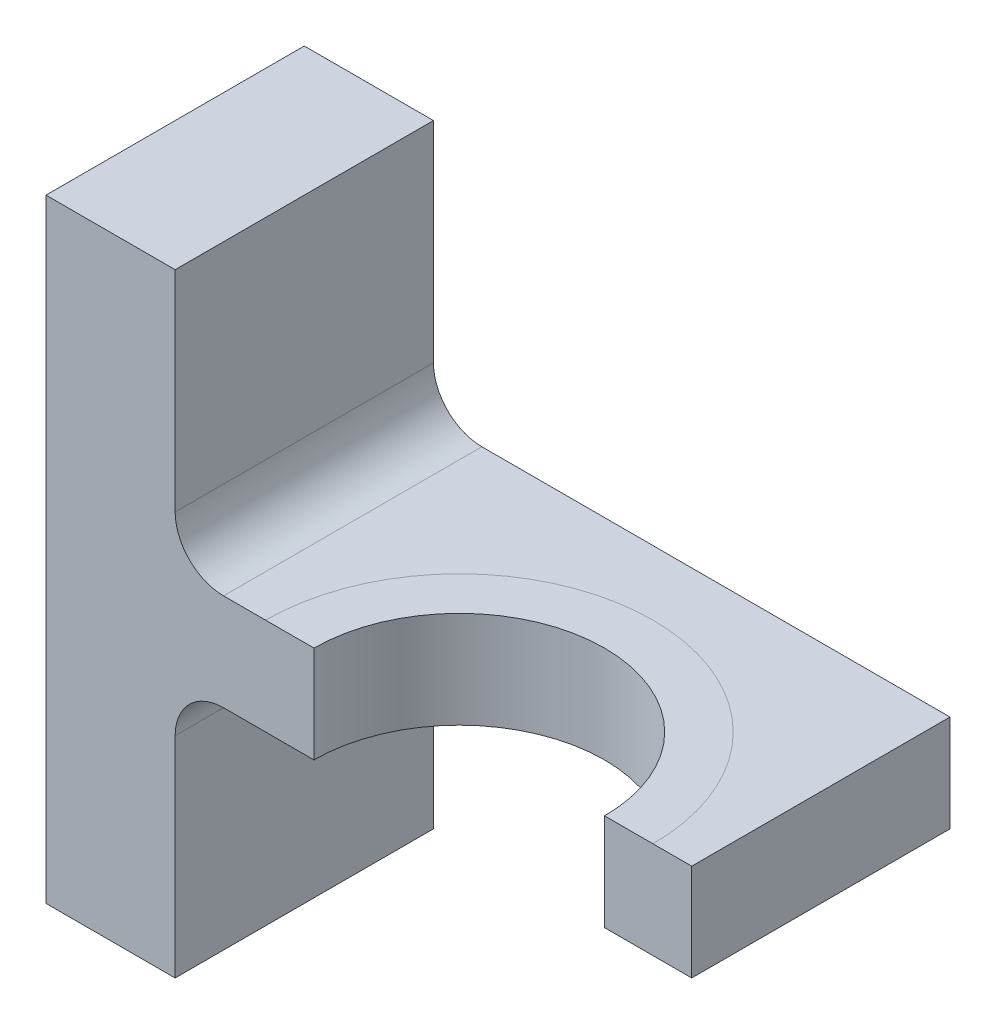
ISO-10303-21;
HEADER;
FILE_DESCRIPTION(('STEP AP214'),'2;1');
FILE_NAME('part.step','',(''),(''),'','','');
FILE_SCHEMA(('AUTOMOTIVE_DESIGN { 1 0 10303 214 1 1 1 1 }'));
ENDSEC;
DATA;
#1=APPLICATION_CONTEXT('core data for automotive mechanical design processes');
#2=APPLICATION_PROTOCOL_DEFINITION('international standard','automotive_design',2000,#1);
#3=PRODUCT_CONTEXT('',#1,'mechanical');
#4=PRODUCT('Part','Part','',(#3));
#5=PRODUCT_RELATED_PRODUCT_CATEGORY('part','',(#4));
#6=PRODUCT_DEFINITION_FORMATION('','',#4);
#7=PRODUCT_DEFINITION_CONTEXT('part definition',#1,'design');
#8=PRODUCT_DEFINITION('design','',#6,#7);
#9=PRODUCT_DEFINITION_SHAPE('','',#8);
#10=(LENGTH_UNIT() NAMED_UNIT(*) SI_UNIT(.MILLI.,.METRE.));
#11=(NAMED_UNIT(*) PLANE_ANGLE_UNIT() SI_UNIT($,.RADIAN.));
#12=(NAMED_UNIT(*) SI_UNIT($,.STERADIAN.) SOLID_ANGLE_UNIT());
#13=UNCERTAINTY_MEASURE_WITH_UNIT(LENGTH_MEASURE(1.E-05),#10,'distance_accuracy_value','');
#14=(GEOMETRIC_REPRESENTATION_CONTEXT(3) GLOBAL_UNCERTAINTY_ASSIGNED_CONTEXT((#13)) GLOBAL_UNIT_ASSIGNED_CONTEXT((#10,
#11,#12)) REPRESENTATION_CONTEXT('',''));
#15=CARTESIAN_POINT('',(0.,0.,0.));
#16=DIRECTION('',(0.,0.,1.));
#17=DIRECTION('',(1.,0.,0.));
#18=AXIS2_PLACEMENT_3D('',#15,#16,#17);
#19=CARTESIAN_POINT('',(-41.9225742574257,265.036597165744,0.));
#20=DIRECTION('',(0.,0.,-1.));
#21=DIRECTION('',(-1.,0.,0.));
#22=AXIS2_PLACEMENT_3D('',#19,#20,#21);
#23=PLANE('',#22);
#24=DIRECTION('',(0.,-1.,0.));
#25=VECTOR('',#24,1.);
#26=CARTESIAN_POINT('',(127.,9.52500000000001,0.));
#27=LINE('',#26,#25);
#28=CARTESIAN_POINT('',(127.,9.52500000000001,0.));
#29=VERTEX_POINT('',#28);
#30=CARTESIAN_POINT('',(127.,-9.52500000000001,0.));
#31=VERTEX_POINT('',#30);
#32=EDGE_CURVE('E196',#29,#31,#27,.T.);
#33=ORIENTED_EDGE('',*,*,#32,.F.);
#34=DIRECTION('',(1.,0.,0.));
#35=VECTOR('',#34,1.);
#36=CARTESIAN_POINT('',(25.4,9.52500000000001,0.));
#37=LINE('',#36,#35);
#38=CARTESIAN_POINT('',(119.38,9.52500000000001,0.));
#39=VERTEX_POINT('',#38);
#40=EDGE_CURVE('E227',#39,#29,#37,.T.);
#41=ORIENTED_EDGE('',*,*,#40,.F.);
#42=DIRECTION('',(1.,0.,0.));
#43=VECTOR('',#42,1.);
#44=CARTESIAN_POINT('',(25.4,9.52500000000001,0.));
#45=LINE('',#44,#43);
#46=CARTESIAN_POINT('',(109.855,9.52500000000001,0.));
#47=VERTEX_POINT('',#46);
#48=EDGE_CURVE('E53',#47,#39,#45,.T.);
#49=ORIENTED_EDGE('',*,*,#48,.F.);
#50=DIRECTION('',(0.,1.,0.));
#51=VECTOR('',#50,1.);
#52=CARTESIAN_POINT('',(109.855,-60.325,0.));
#53=LINE('',#52,#51);
#54=CARTESIAN_POINT('',(109.855,-9.52500000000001,0.));
#55=VERTEX_POINT('',#54);
#56=EDGE_CURVE('E228',#55,#47,#53,.T.);
#57=ORIENTED_EDGE('',*,*,#56,.F.);
#58=DIRECTION('',(-1.,0.,0.));
#59=VECTOR('',#58,1.);
#60=CARTESIAN_POINT('',(25.4,-9.52500000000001,0.));
#61=LINE('',#60,#59);
#62=EDGE_CURVE('E240',#31,#55,#61,.T.);
#63=ORIENTED_EDGE('',*,*,#62,.F.);
#64=EDGE_LOOP('',(#33,#41,#49,#57,#63));
#65=FACE_BOUND('',#64,.T.);
#66=ADVANCED_FACE('F38',(#65),#23,.F.);
#67=CARTESIAN_POINT('',(25.4,9.52500000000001,50.8));
#68=DIRECTION('',(0.,-1.,0.));
#69=DIRECTION('',(1.,0.,0.));
#70=AXIS2_PLACEMENT_3D('',#67,#68,#69);
#71=PLANE('',#70);
#72=DIRECTION('',(0.,0.,-1.));
#73=VECTOR('',#72,1.);
#74=CARTESIAN_POINT('',(34.925,9.52500000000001,50.8));
#75=LINE('',#74,#73);
#76=CARTESIAN_POINT('',(34.925,9.52500000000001,-50.8));
#77=VERTEX_POINT('',#76);
#78=CARTESIAN_POINT('',(34.925,9.52500000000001,0.));
#79=VERTEX_POINT('',#78);
#80=EDGE_CURVE('E146',#77,#79,#75,.F.);
#81=ORIENTED_EDGE('',*,*,#80,.T.);
#82=CARTESIAN_POINT('',(43.18,9.52500000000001,0.));
#83=VERTEX_POINT('',#82);
#84=EDGE_CURVE('E61',#79,#83,#37,.T.);
#85=ORIENTED_EDGE('',*,*,#84,.T.);
#86=CARTESIAN_POINT('',(81.28,9.52500000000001,0.));
#87=DIRECTION('',(0.,-1.,0.));
#88=DIRECTION('',(1.,0.,0.));
#89=AXIS2_PLACEMENT_3D('',#86,#87,#88);
#90=CIRCLE('',#89,38.1);
#91=EDGE_CURVE('E191',#39,#83,#90,.F.);
#92=ORIENTED_EDGE('',*,*,#91,.F.);
#93=ORIENTED_EDGE('',*,*,#40,.T.);
#94=DIRECTION('',(0.,0.,-1.));
#95=VECTOR('',#94,1.);
#96=CARTESIAN_POINT('',(127.,9.52500000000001,50.8));
#97=LINE('',#96,#95);
#98=CARTESIAN_POINT('',(127.,9.52500000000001,-50.8));
#99=VERTEX_POINT('',#98);
#100=EDGE_CURVE('E169',#29,#99,#97,.T.);
#101=ORIENTED_EDGE('',*,*,#100,.T.);
#102=DIRECTION('',(-1.,0.,0.));
#103=VECTOR('',#102,1.);
#104=CARTESIAN_POINT('',(25.4,9.52500000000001,-50.8));
#105=LINE('',#104,#103);
#106=EDGE_CURVE('E162',#99,#77,#105,.T.);
#107=ORIENTED_EDGE('',*,*,#106,.T.);
#108=EDGE_LOOP('',(#81,#85,#92,#93,#101,#107));
#109=FACE_BOUND('',#108,.T.);
#110=ADVANCED_FACE('F166',(#109),#71,.F.);
#111=CARTESIAN_POINT('',(0.,60.325,50.8));
#112=DIRECTION('',(1.,0.,0.));
#113=DIRECTION('',(0.,0.,-1.));
#114=AXIS2_PLACEMENT_3D('',#111,#112,#113);
#115=PLANE('',#114);
#116=DIRECTION('',(0.,0.,-1.));
#117=VECTOR('',#116,1.);
#118=CARTESIAN_POINT('',(0.,-60.325,50.8));
#119=LINE('',#118,#117);
#120=CARTESIAN_POINT('',(0.,-60.325,0.));
#121=VERTEX_POINT('',#120);
#122=CARTESIAN_POINT('',(0.,-60.325,-50.8));
#123=VERTEX_POINT('',#122);
#124=EDGE_CURVE('E189',#121,#123,#119,.T.);
#125=ORIENTED_EDGE('',*,*,#124,.F.);
#126=DIRECTION('',(0.,1.,0.));
#127=VECTOR('',#126,1.);
#128=CARTESIAN_POINT('',(0.,60.325,0.));
#129=LINE('',#128,#127);
#130=CARTESIAN_POINT('',(0.,60.325,0.));
#131=VERTEX_POINT('',#130);
#132=EDGE_CURVE('E243',#121,#131,#129,.T.);
#133=ORIENTED_EDGE('',*,*,#132,.T.);
#134=DIRECTION('',(0.,0.,-1.));
#135=VECTOR('',#134,1.);
#136=CARTESIAN_POINT('',(0.,60.325,50.8));
#137=LINE('',#136,#135);
#138=CARTESIAN_POINT('',(0.,60.325,-50.8));
#139=VERTEX_POINT('',#138);
#140=EDGE_CURVE('E181',#131,#139,#137,.T.);
#141=ORIENTED_EDGE('',*,*,#140,.T.);
#142=DIRECTION('',(0.,-1.,0.));
#143=VECTOR('',#142,1.);
#144=CARTESIAN_POINT('',(0.,60.325,-50.8));
#145=LINE('',#144,#143);
#146=EDGE_CURVE('E221',#139,#123,#145,.T.);
#147=ORIENTED_EDGE('',*,*,#146,.T.);
#148=EDGE_LOOP('',(#125,#133,#141,#147));
#149=FACE_BOUND('',#148,.T.);
#150=ADVANCED_FACE('F275',(#149),#115,.F.);
#151=CARTESIAN_POINT('',(0.,-60.325,50.8));
#152=DIRECTION('',(0.,1.,0.));
#153=DIRECTION('',(0.,0.,1.));
#154=AXIS2_PLACEMENT_3D('',#151,#152,#153);
#155=PLANE('',#154);
#156=DIRECTION('',(0.,0.,-1.));
#157=VECTOR('',#156,1.);
#158=CARTESIAN_POINT('',(25.4,-60.325,50.8));
#159=LINE('',#158,#157);
#160=CARTESIAN_POINT('',(25.4,-60.325,0.));
#161=VERTEX_POINT('',#160);
#162=CARTESIAN_POINT('',(25.4,-60.325,-50.8));
#163=VERTEX_POINT('',#162);
#164=EDGE_CURVE('E187',#161,#163,#159,.T.);
#165=ORIENTED_EDGE('',*,*,#164,.F.);
#166=DIRECTION('',(-1.,0.,0.));
#167=VECTOR('',#166,1.);
#168=CARTESIAN_POINT('',(0.,-60.325,0.));
#169=LINE('',#168,#167);
#170=EDGE_CURVE('E235',#161,#121,#169,.T.);
#171=ORIENTED_EDGE('',*,*,#170,.T.);
#172=ORIENTED_EDGE('',*,*,#124,.T.);
#173=DIRECTION('',(1.,0.,0.));
#174=VECTOR('',#173,1.);
#175=CARTESIAN_POINT('',(0.,-60.325,-50.8));
#176=LINE('',#175,#174);
#177=EDGE_CURVE('E216',#123,#163,#176,.T.);
#178=ORIENTED_EDGE('',*,*,#177,.T.);
#179=EDGE_LOOP('',(#165,#171,#172,#178));
#180=FACE_BOUND('',#179,.T.);
#181=ADVANCED_FACE('F290',(#180),#155,.F.);
#182=CARTESIAN_POINT('',(25.4,-60.325,50.8));
#183=DIRECTION('',(-1.,0.,0.));
#184=DIRECTION('',(0.,0.,1.));
#185=AXIS2_PLACEMENT_3D('',#182,#183,#184);
#186=PLANE('',#185);
#187=DIRECTION('',(0.,0.,-1.));
#188=VECTOR('',#187,1.);
#189=CARTESIAN_POINT('',(25.4,-19.05,50.8));
#190=LINE('',#189,#188);
#191=CARTESIAN_POINT('',(25.4,-19.05,-50.8));
#192=VERTEX_POINT('',#191);
#193=CARTESIAN_POINT('',(25.4,-19.05,0.));
#194=VERTEX_POINT('',#193);
#195=EDGE_CURVE('E147',#192,#194,#190,.F.);
#196=ORIENTED_EDGE('',*,*,#195,.T.);
#197=DIRECTION('',(0.,-1.,0.));
#198=VECTOR('',#197,1.);
#199=CARTESIAN_POINT('',(25.4,-60.325,0.));
#200=LINE('',#199,#198);
#201=EDGE_CURVE('E230',#194,#161,#200,.T.);
#202=ORIENTED_EDGE('',*,*,#201,.T.);
#203=ORIENTED_EDGE('',*,*,#164,.T.);
#204=DIRECTION('',(0.,1.,0.));
#205=VECTOR('',#204,1.);
#206=CARTESIAN_POINT('',(25.4,-60.325,-50.8));
#207=LINE('',#206,#205);
#208=EDGE_CURVE('E215',#163,#192,#207,.T.);
#209=ORIENTED_EDGE('',*,*,#208,.T.);
#210=EDGE_LOOP('',(#196,#202,#203,#209));
#211=FACE_BOUND('',#210,.T.);
#212=ADVANCED_FACE('F268',(#211),#186,.F.);
#213=CARTESIAN_POINT('',(25.4,-9.52500000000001,50.8));
#214=DIRECTION('',(0.,1.,0.));
#215=DIRECTION('',(-1.,0.,0.));
#216=AXIS2_PLACEMENT_3D('',#213,#214,#215);
#217=PLANE('',#216);
#218=DIRECTION('',(0.,0.,-1.));
#219=VECTOR('',#218,1.);
#220=CARTESIAN_POINT('',(127.,-9.52500000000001,50.8));
#221=LINE('',#220,#219);
#222=CARTESIAN_POINT('',(127.,-9.52500000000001,-50.8));
#223=VERTEX_POINT('',#222);
#224=EDGE_CURVE('E185',#31,#223,#221,.T.);
#225=ORIENTED_EDGE('',*,*,#224,.F.);
#226=ORIENTED_EDGE('',*,*,#62,.T.);
#227=CARTESIAN_POINT('',(81.28,-9.52500000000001,0.));
#228=DIRECTION('',(0.,1.,0.));
#229=DIRECTION('',(-1.,0.,0.));
#230=AXIS2_PLACEMENT_3D('',#227,#228,#229);
#231=CIRCLE('',#230,28.575);
#232=CARTESIAN_POINT('',(52.705,-9.52500000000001,0.));
#233=VERTEX_POINT('',#232);
#234=EDGE_CURVE('E195',#55,#233,#231,.T.);
#235=ORIENTED_EDGE('',*,*,#234,.T.);
#236=CARTESIAN_POINT('',(34.925,-9.52500000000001,0.));
#237=VERTEX_POINT('',#236);
#238=EDGE_CURVE('E208',#233,#237,#61,.T.);
#239=ORIENTED_EDGE('',*,*,#238,.T.);
#240=DIRECTION('',(0.,0.,-1.));
#241=VECTOR('',#240,1.);
#242=CARTESIAN_POINT('',(34.925,-9.52500000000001,-50.8));
#243=LINE('',#242,#241);
#244=CARTESIAN_POINT('',(34.925,-9.52500000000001,-50.8));
#245=VERTEX_POINT('',#244);
#246=EDGE_CURVE('E152',#237,#245,#243,.T.);
#247=ORIENTED_EDGE('',*,*,#246,.T.);
#248=DIRECTION('',(1.,0.,0.));
#249=VECTOR('',#248,1.);
#250=CARTESIAN_POINT('',(25.4,-9.52500000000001,-50.8));
#251=LINE('',#250,#249);
#252=EDGE_CURVE('E175',#245,#223,#251,.T.);
#253=ORIENTED_EDGE('',*,*,#252,.T.);
#254=EDGE_LOOP('',(#225,#226,#235,#239,#247,#253));
#255=FACE_BOUND('',#254,.T.);
#256=ADVANCED_FACE('F205',(#255),#217,.F.);
#257=CARTESIAN_POINT('',(127.,9.52500000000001,50.8));
#258=DIRECTION('',(-1.,0.,0.));
#259=DIRECTION('',(0.,0.,1.));
#260=AXIS2_PLACEMENT_3D('',#257,#258,#259);
#261=PLANE('',#260);
#262=ORIENTED_EDGE('',*,*,#100,.F.);
#263=ORIENTED_EDGE('',*,*,#32,.T.);
#264=ORIENTED_EDGE('',*,*,#224,.T.);
#265=DIRECTION('',(0.,1.,0.));
#266=VECTOR('',#265,1.);
#267=CARTESIAN_POINT('',(127.,9.52500000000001,-50.8));
#268=LINE('',#267,#266);
#269=EDGE_CURVE('E171',#223,#99,#268,.T.);
#270=ORIENTED_EDGE('',*,*,#269,.T.);
#271=EDGE_LOOP('',(#262,#263,#264,#270));
#272=FACE_BOUND('',#271,.T.);
#273=ADVANCED_FACE('F260',(#272),#261,.F.);
#274=ORIENTED_EDGE('',*,*,#91,.T.);
#275=CARTESIAN_POINT('',(52.705,9.52500000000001,0.));
#276=VERTEX_POINT('',#275);
#277=EDGE_CURVE('E246',#83,#276,#45,.T.);
#278=ORIENTED_EDGE('',*,*,#277,.T.);
#279=CARTESIAN_POINT('',(81.28,9.52500000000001,0.));
#280=DIRECTION('',(0.,-1.,0.));
#281=DIRECTION('',(1.,0.,0.));
#282=AXIS2_PLACEMENT_3D('',#279,#280,#281);
#283=CIRCLE('',#282,28.575);
#284=EDGE_CURVE('E192',#276,#47,#283,.T.);
#285=ORIENTED_EDGE('',*,*,#284,.T.);
#286=ORIENTED_EDGE('',*,*,#48,.T.);
#287=EDGE_LOOP('',(#274,#278,#285,#286));
#288=FACE_BOUND('',#287,.T.);
#289=ADVANCED_FACE('F255',(#288),#71,.F.);
#290=CARTESIAN_POINT('',(25.4,60.325,50.8));
#291=DIRECTION('',(-1.,0.,0.));
#292=DIRECTION('',(0.,0.,1.));
#293=AXIS2_PLACEMENT_3D('',#290,#291,#292);
#294=PLANE('',#293);
#295=DIRECTION('',(0.,0.,-1.));
#296=VECTOR('',#295,1.);
#297=CARTESIAN_POINT('',(25.4,60.325,50.8));
#298=LINE('',#297,#296);
#299=CARTESIAN_POINT('',(25.4,60.325,0.));
#300=VERTEX_POINT('',#299);
#301=CARTESIAN_POINT('',(25.4,60.325,-50.8));
#302=VERTEX_POINT('',#301);
#303=EDGE_CURVE('E143',#300,#302,#298,.T.);
#304=ORIENTED_EDGE('',*,*,#303,.F.);
#305=DIRECTION('',(0.,-1.,0.));
#306=VECTOR('',#305,1.);
#307=CARTESIAN_POINT('',(25.4,60.325,0.));
#308=LINE('',#307,#306);
#309=CARTESIAN_POINT('',(25.4,19.05,0.));
#310=VERTEX_POINT('',#309);
#311=EDGE_CURVE('E131',#300,#310,#308,.T.);
#312=ORIENTED_EDGE('',*,*,#311,.T.);
#313=DIRECTION('',(0.,0.,-1.));
#314=VECTOR('',#313,1.);
#315=CARTESIAN_POINT('',(25.4,19.05,-50.8));
#316=LINE('',#315,#314);
#317=CARTESIAN_POINT('',(25.4,19.05,-50.8));
#318=VERTEX_POINT('',#317);
#319=EDGE_CURVE('E141',#310,#318,#316,.T.);
#320=ORIENTED_EDGE('',*,*,#319,.T.);
#321=DIRECTION('',(0.,1.,0.));
#322=VECTOR('',#321,1.);
#323=CARTESIAN_POINT('',(25.4,60.325,-50.8));
#324=LINE('',#323,#322);
#325=EDGE_CURVE('E164',#318,#302,#324,.T.);
#326=ORIENTED_EDGE('',*,*,#325,.T.);
#327=EDGE_LOOP('',(#304,#312,#320,#326));
#328=FACE_BOUND('',#327,.T.);
#329=ADVANCED_FACE('F139',(#328),#294,.F.);
#330=CARTESIAN_POINT('',(0.,60.325,50.8));
#331=DIRECTION('',(0.,-1.,0.));
#332=DIRECTION('',(0.,0.,-1.));
#333=AXIS2_PLACEMENT_3D('',#330,#331,#332);
#334=PLANE('',#333);
#335=ORIENTED_EDGE('',*,*,#140,.F.);
#336=DIRECTION('',(1.,0.,0.));
#337=VECTOR('',#336,1.);
#338=CARTESIAN_POINT('',(0.,60.325,0.));
#339=LINE('',#338,#337);
#340=EDGE_CURVE('E249',#131,#300,#339,.T.);
#341=ORIENTED_EDGE('',*,*,#340,.T.);
#342=ORIENTED_EDGE('',*,*,#303,.T.);
#343=DIRECTION('',(-1.,0.,0.));
#344=VECTOR('',#343,1.);
#345=CARTESIAN_POINT('',(0.,60.325,-50.8));
#346=LINE('',#345,#344);
#347=EDGE_CURVE('E173',#302,#139,#346,.T.);
#348=ORIENTED_EDGE('',*,*,#347,.T.);
#349=EDGE_LOOP('',(#335,#341,#342,#348));
#350=FACE_BOUND('',#349,.T.);
#351=ADVANCED_FACE('F304',(#350),#334,.F.);
#352=CARTESIAN_POINT('',(0.,-60.325,-50.8));
#353=DIRECTION('',(0.,0.,1.));
#354=DIRECTION('',(1.,0.,0.));
#355=AXIS2_PLACEMENT_3D('',#352,#353,#354);
#356=PLANE('',#355);
#357=ORIENTED_EDGE('',*,*,#146,.F.);
#358=ORIENTED_EDGE('',*,*,#347,.F.);
#359=ORIENTED_EDGE('',*,*,#325,.F.);
#360=CARTESIAN_POINT('',(34.925,19.05,-50.8));
#361=DIRECTION('',(0.,0.,1.));
#362=DIRECTION('',(1.,0.,0.));
#363=AXIS2_PLACEMENT_3D('',#360,#361,#362);
#364=CIRCLE('',#363,9.525);
#365=EDGE_CURVE('E46',#318,#77,#364,.T.);
#366=ORIENTED_EDGE('',*,*,#365,.T.);
#367=ORIENTED_EDGE('',*,*,#106,.F.);
#368=ORIENTED_EDGE('',*,*,#269,.F.);
#369=ORIENTED_EDGE('',*,*,#252,.F.);
#370=CARTESIAN_POINT('',(34.925,-19.05,-50.8));
#371=DIRECTION('',(0.,0.,1.));
#372=DIRECTION('',(1.,0.,0.));
#373=AXIS2_PLACEMENT_3D('',#370,#371,#372);
#374=CIRCLE('',#373,9.525);
#375=EDGE_CURVE('E149',#245,#192,#374,.T.);
#376=ORIENTED_EDGE('',*,*,#375,.T.);
#377=ORIENTED_EDGE('',*,*,#208,.F.);
#378=ORIENTED_EDGE('',*,*,#177,.F.);
#379=EDGE_LOOP('',(#357,#358,#359,#366,#367,#368,#369,#376,#377,#378));
#380=FACE_BOUND('',#379,.T.);
#381=ADVANCED_FACE('F160',(#380),#356,.F.);
#382=CARTESIAN_POINT('',(81.28,-60.325,0.));
#383=DIRECTION('',(0.,1.,0.));
#384=DIRECTION('',(0.,0.,1.));
#385=AXIS2_PLACEMENT_3D('',#382,#383,#384);
#386=CYLINDRICAL_SURFACE('',#385,28.575);
#387=ORIENTED_EDGE('',*,*,#284,.F.);
#388=DIRECTION('',(0.,1.,0.));
#389=VECTOR('',#388,1.);
#390=CARTESIAN_POINT('',(52.705,-60.325,0.));
#391=LINE('',#390,#389);
#392=EDGE_CURVE('E239',#276,#233,#391,.F.);
#393=ORIENTED_EDGE('',*,*,#392,.T.);
#394=ORIENTED_EDGE('',*,*,#234,.F.);
#395=ORIENTED_EDGE('',*,*,#56,.T.);
#396=EDGE_LOOP('',(#387,#393,#394,#395));
#397=FACE_BOUND('',#396,.T.);
#398=ADVANCED_FACE('F258',(#397),#386,.F.);
#399=CARTESIAN_POINT('',(34.925,-19.05,50.8));
#400=DIRECTION('',(0.,0.,1.));
#401=DIRECTION('',(1.,0.,0.));
#402=AXIS2_PLACEMENT_3D('',#399,#400,#401);
#403=CYLINDRICAL_SURFACE('',#402,9.525);
#404=ORIENTED_EDGE('',*,*,#246,.F.);
#405=CARTESIAN_POINT('',(34.925,-19.05,0.));
#406=DIRECTION('',(0.,0.,-1.));
#407=DIRECTION('',(-1.,0.,0.));
#408=AXIS2_PLACEMENT_3D('',#405,#406,#407);
#409=CIRCLE('',#408,9.525);
#410=EDGE_CURVE('E233',#237,#194,#409,.F.);
#411=ORIENTED_EDGE('',*,*,#410,.T.);
#412=ORIENTED_EDGE('',*,*,#195,.F.);
#413=ORIENTED_EDGE('',*,*,#375,.F.);
#414=EDGE_LOOP('',(#404,#411,#412,#413));
#415=FACE_BOUND('',#414,.T.);
#416=ADVANCED_FACE('F212',(#415),#403,.F.);
#417=CARTESIAN_POINT('',(34.925,19.05,50.8));
#418=DIRECTION('',(0.,0.,1.));
#419=DIRECTION('',(1.,0.,0.));
#420=AXIS2_PLACEMENT_3D('',#417,#418,#419);
#421=CYLINDRICAL_SURFACE('',#420,9.525);
#422=ORIENTED_EDGE('',*,*,#319,.F.);
#423=CARTESIAN_POINT('',(34.925,19.05,0.));
#424=DIRECTION('',(0.,0.,-1.));
#425=DIRECTION('',(-1.,0.,0.));
#426=AXIS2_PLACEMENT_3D('',#423,#424,#425);
#427=CIRCLE('',#426,9.525);
#428=EDGE_CURVE('E11',#310,#79,#427,.F.);
#429=ORIENTED_EDGE('',*,*,#428,.T.);
#430=ORIENTED_EDGE('',*,*,#80,.F.);
#431=ORIENTED_EDGE('',*,*,#365,.F.);
#432=EDGE_LOOP('',(#422,#429,#430,#431));
#433=FACE_BOUND('',#432,.T.);
#434=ADVANCED_FACE('F40',(#433),#421,.F.);
#435=ORIENTED_EDGE('',*,*,#201,.F.);
#436=ORIENTED_EDGE('',*,*,#410,.F.);
#437=ORIENTED_EDGE('',*,*,#238,.F.);
#438=ORIENTED_EDGE('',*,*,#392,.F.);
#439=ORIENTED_EDGE('',*,*,#277,.F.);
#440=ORIENTED_EDGE('',*,*,#84,.F.);
#441=ORIENTED_EDGE('',*,*,#428,.F.);
#442=ORIENTED_EDGE('',*,*,#311,.F.);
#443=ORIENTED_EDGE('',*,*,#340,.F.);
#444=ORIENTED_EDGE('',*,*,#132,.F.);
#445=ORIENTED_EDGE('',*,*,#170,.F.);
#446=EDGE_LOOP('',(#435,#436,#437,#438,#439,#440,#441,#442,#443,#444,#445));
#447=FACE_BOUND('',#446,.T.);
#448=ADVANCED_FACE('F130',(#447),#23,.F.);
#449=CLOSED_SHELL('',(#66,#110,#150,#181,#212,#256,#273,#289,#329,#351,#381,#398,#416,#434,#448));
#450=MANIFOLD_SOLID_BREP('B2',#449);
#451=ADVANCED_BREP_SHAPE_REPRESENTATION('',(#18,#450),#14);
#452=SHAPE_DEFINITION_REPRESENTATION(#9,#451);
ENDSEC;
END-ISO-10303-21;
